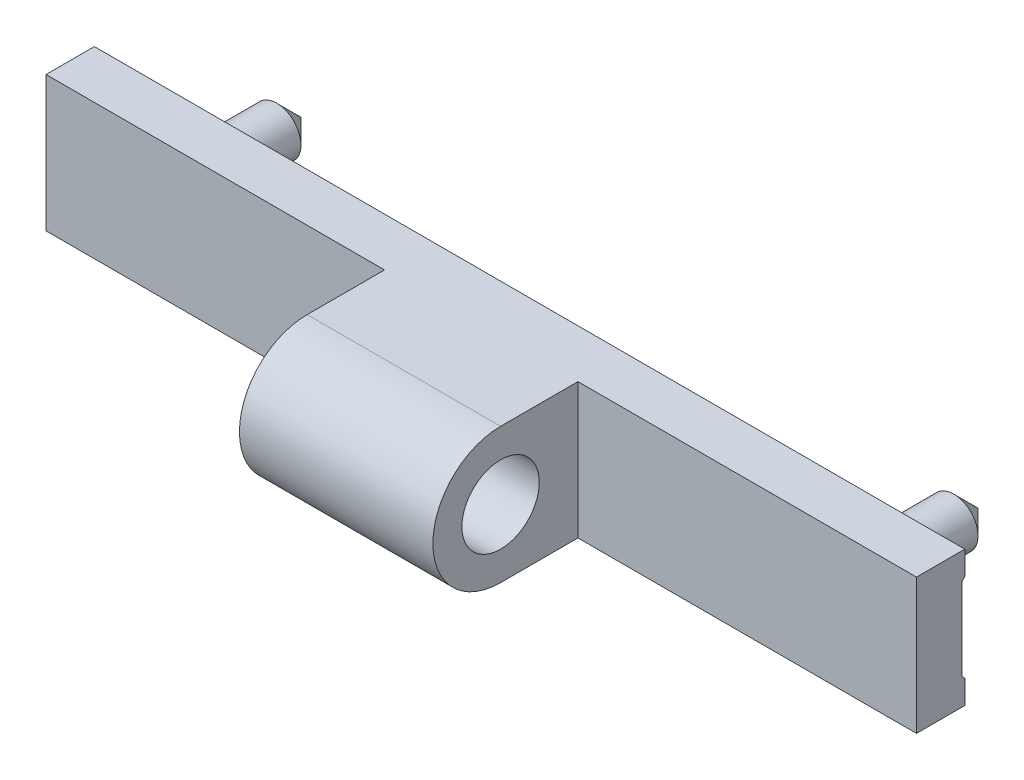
ISO-10303-21;
HEADER;
FILE_DESCRIPTION(('STEP AP214'),'2;1');
FILE_NAME('part.step','',(''),(''),'','','');
FILE_SCHEMA(('AUTOMOTIVE_DESIGN { 1 0 10303 214 1 1 1 1 }'));
ENDSEC;
DATA;
#1=APPLICATION_CONTEXT('core data for automotive mechanical design processes');
#2=APPLICATION_PROTOCOL_DEFINITION('international standard','automotive_design',2000,#1);
#3=PRODUCT_CONTEXT('',#1,'mechanical');
#4=PRODUCT('Part','Part','',(#3));
#5=PRODUCT_RELATED_PRODUCT_CATEGORY('part','',(#4));
#6=PRODUCT_DEFINITION_FORMATION('','',#4);
#7=PRODUCT_DEFINITION_CONTEXT('part definition',#1,'design');
#8=PRODUCT_DEFINITION('design','',#6,#7);
#9=PRODUCT_DEFINITION_SHAPE('','',#8);
#10=(LENGTH_UNIT() NAMED_UNIT(*) SI_UNIT(.MILLI.,.METRE.));
#11=(NAMED_UNIT(*) PLANE_ANGLE_UNIT() SI_UNIT($,.RADIAN.));
#12=(NAMED_UNIT(*) SI_UNIT($,.STERADIAN.) SOLID_ANGLE_UNIT());
#13=UNCERTAINTY_MEASURE_WITH_UNIT(LENGTH_MEASURE(1.E-05),#10,'distance_accuracy_value','');
#14=(GEOMETRIC_REPRESENTATION_CONTEXT(3) GLOBAL_UNCERTAINTY_ASSIGNED_CONTEXT((#13)) GLOBAL_UNIT_ASSIGNED_CONTEXT((#10,
#11,#12)) REPRESENTATION_CONTEXT('',''));
#15=CARTESIAN_POINT('',(0.,0.,0.));
#16=DIRECTION('',(0.,0.,1.));
#17=DIRECTION('',(1.,0.,0.));
#18=AXIS2_PLACEMENT_3D('',#15,#16,#17);
#19=CARTESIAN_POINT('',(80.,0.,13.));
#20=DIRECTION('',(-1.,0.,0.));
#21=DIRECTION('',(0.,-1.,0.));
#22=AXIS2_PLACEMENT_3D('',#19,#20,#21);
#23=CYLINDRICAL_SURFACE('',#22,7.);
#24=CARTESIAN_POINT('',(45.,0.,13.));
#25=DIRECTION('',(1.,0.,0.));
#26=DIRECTION('',(0.,1.,0.));
#27=AXIS2_PLACEMENT_3D('',#24,#25,#26);
#28=CIRCLE('',#27,7.);
#29=CARTESIAN_POINT('',(45.,7.,13.));
#30=VERTEX_POINT('',#29);
#31=CARTESIAN_POINT('',(45.,-7.,13.));
#32=VERTEX_POINT('',#31);
#33=EDGE_CURVE('E146',#30,#32,#28,.T.);
#34=ORIENTED_EDGE('',*,*,#33,.F.);
#35=DIRECTION('',(-1.,0.,0.));
#36=VECTOR('',#35,1.);
#37=CARTESIAN_POINT('',(80.,7.,13.));
#38=LINE('',#37,#36);
#39=CARTESIAN_POINT('',(25.,7.,13.));
#40=VERTEX_POINT('',#39);
#41=EDGE_CURVE('E165',#30,#40,#38,.T.);
#42=ORIENTED_EDGE('',*,*,#41,.T.);
#43=CARTESIAN_POINT('',(25.,0.,13.));
#44=DIRECTION('',(-1.,0.,0.));
#45=DIRECTION('',(0.,-1.,0.));
#46=AXIS2_PLACEMENT_3D('',#43,#44,#45);
#47=CIRCLE('',#46,7.);
#48=CARTESIAN_POINT('',(25.,-7.,13.));
#49=VERTEX_POINT('',#48);
#50=EDGE_CURVE('E141',#49,#40,#47,.T.);
#51=ORIENTED_EDGE('',*,*,#50,.F.);
#52=DIRECTION('',(-1.,0.,0.));
#53=VECTOR('',#52,1.);
#54=CARTESIAN_POINT('',(80.,-7.,13.));
#55=LINE('',#54,#53);
#56=EDGE_CURVE('E199',#32,#49,#55,.T.);
#57=ORIENTED_EDGE('',*,*,#56,.F.);
#58=EDGE_LOOP('',(#34,#42,#51,#57));
#59=FACE_BOUND('',#58,.T.);
#60=ADVANCED_FACE('F14',(#59),#23,.T.);
#61=CARTESIAN_POINT('',(80.,-7.,13.));
#62=DIRECTION('',(0.,1.,0.));
#63=DIRECTION('',(-1.,0.,0.));
#64=AXIS2_PLACEMENT_3D('',#61,#62,#63);
#65=PLANE('',#64);
#66=DIRECTION('',(0.,0.,-1.));
#67=VECTOR('',#66,1.);
#68=CARTESIAN_POINT('',(25.,-7.,25.));
#69=LINE('',#68,#67);
#70=CARTESIAN_POINT('',(25.,-7.,5.));
#71=VERTEX_POINT('',#70);
#72=EDGE_CURVE('E131',#49,#71,#69,.T.);
#73=ORIENTED_EDGE('',*,*,#72,.T.);
#74=DIRECTION('',(1.,0.,0.));
#75=VECTOR('',#74,1.);
#76=CARTESIAN_POINT('',(-10.,-7.,5.));
#77=LINE('',#76,#75);
#78=CARTESIAN_POINT('',(-10.,-7.,5.));
#79=VERTEX_POINT('',#78);
#80=EDGE_CURVE('E127',#79,#71,#77,.T.);
#81=ORIENTED_EDGE('',*,*,#80,.F.);
#82=DIRECTION('',(0.,0.,-1.));
#83=VECTOR('',#82,1.);
#84=CARTESIAN_POINT('',(-10.,-7.,13.));
#85=LINE('',#84,#83);
#86=CARTESIAN_POINT('',(-10.,-7.,0.));
#87=VERTEX_POINT('',#86);
#88=EDGE_CURVE('E148',#79,#87,#85,.T.);
#89=ORIENTED_EDGE('',*,*,#88,.T.);
#90=DIRECTION('',(-1.,0.,0.));
#91=VECTOR('',#90,1.);
#92=CARTESIAN_POINT('',(80.,-7.,0.));
#93=LINE('',#92,#91);
#94=CARTESIAN_POINT('',(80.,-7.,0.));
#95=VERTEX_POINT('',#94);
#96=EDGE_CURVE('E196',#95,#87,#93,.T.);
#97=ORIENTED_EDGE('',*,*,#96,.F.);
#98=DIRECTION('',(0.,0.,-1.));
#99=VECTOR('',#98,1.);
#100=CARTESIAN_POINT('',(80.,-7.,13.));
#101=LINE('',#100,#99);
#102=CARTESIAN_POINT('',(80.,-7.,5.));
#103=VERTEX_POINT('',#102);
#104=EDGE_CURVE('E149',#103,#95,#101,.T.);
#105=ORIENTED_EDGE('',*,*,#104,.F.);
#106=DIRECTION('',(1.,0.,0.));
#107=VECTOR('',#106,1.);
#108=CARTESIAN_POINT('',(45.,-7.,5.));
#109=LINE('',#108,#107);
#110=CARTESIAN_POINT('',(45.,-7.,5.));
#111=VERTEX_POINT('',#110);
#112=EDGE_CURVE('E28',#111,#103,#109,.T.);
#113=ORIENTED_EDGE('',*,*,#112,.F.);
#114=DIRECTION('',(0.,0.,-1.));
#115=VECTOR('',#114,1.);
#116=CARTESIAN_POINT('',(45.,-7.,25.));
#117=LINE('',#116,#115);
#118=EDGE_CURVE('E134',#32,#111,#117,.T.);
#119=ORIENTED_EDGE('',*,*,#118,.F.);
#120=ORIENTED_EDGE('',*,*,#56,.T.);
#121=EDGE_LOOP('',(#73,#81,#89,#97,#105,#113,#119,#120));
#122=FACE_BOUND('',#121,.T.);
#123=ADVANCED_FACE('F254',(#122),#65,.F.);
#124=CARTESIAN_POINT('',(80.,7.,0.));
#125=DIRECTION('',(0.,-1.,0.));
#126=DIRECTION('',(1.,0.,0.));
#127=AXIS2_PLACEMENT_3D('',#124,#125,#126);
#128=PLANE('',#127);
#129=DIRECTION('',(-1.,0.,0.));
#130=VECTOR('',#129,1.);
#131=CARTESIAN_POINT('',(80.,7.,5.));
#132=LINE('',#131,#130);
#133=CARTESIAN_POINT('',(80.,7.,5.));
#134=VERTEX_POINT('',#133);
#135=CARTESIAN_POINT('',(45.,7.,5.));
#136=VERTEX_POINT('',#135);
#137=EDGE_CURVE('E137',#134,#136,#132,.T.);
#138=ORIENTED_EDGE('',*,*,#137,.F.);
#139=DIRECTION('',(0.,0.,1.));
#140=VECTOR('',#139,1.);
#141=CARTESIAN_POINT('',(80.,7.,0.));
#142=LINE('',#141,#140);
#143=CARTESIAN_POINT('',(80.,7.,0.));
#144=VERTEX_POINT('',#143);
#145=EDGE_CURVE('E162',#144,#134,#142,.T.);
#146=ORIENTED_EDGE('',*,*,#145,.F.);
#147=DIRECTION('',(-1.,0.,0.));
#148=VECTOR('',#147,1.);
#149=CARTESIAN_POINT('',(80.,7.,0.));
#150=LINE('',#149,#148);
#151=CARTESIAN_POINT('',(-10.,7.,0.));
#152=VERTEX_POINT('',#151);
#153=EDGE_CURVE('E181',#144,#152,#150,.T.);
#154=ORIENTED_EDGE('',*,*,#153,.T.);
#155=DIRECTION('',(0.,0.,1.));
#156=VECTOR('',#155,1.);
#157=CARTESIAN_POINT('',(-10.,7.,0.));
#158=LINE('',#157,#156);
#159=CARTESIAN_POINT('',(-10.,7.,5.));
#160=VERTEX_POINT('',#159);
#161=EDGE_CURVE('E152',#152,#160,#158,.T.);
#162=ORIENTED_EDGE('',*,*,#161,.T.);
#163=CARTESIAN_POINT('',(25.,7.,5.));
#164=VERTEX_POINT('',#163);
#165=EDGE_CURVE('E36',#164,#160,#132,.T.);
#166=ORIENTED_EDGE('',*,*,#165,.F.);
#167=DIRECTION('',(0.,0.,-1.));
#168=VECTOR('',#167,1.);
#169=CARTESIAN_POINT('',(25.,7.,0.));
#170=LINE('',#169,#168);
#171=EDGE_CURVE('E204',#40,#164,#170,.T.);
#172=ORIENTED_EDGE('',*,*,#171,.F.);
#173=ORIENTED_EDGE('',*,*,#41,.F.);
#174=DIRECTION('',(0.,0.,1.));
#175=VECTOR('',#174,1.);
#176=CARTESIAN_POINT('',(45.,7.,0.));
#177=LINE('',#176,#175);
#178=EDGE_CURVE('E206',#136,#30,#177,.T.);
#179=ORIENTED_EDGE('',*,*,#178,.F.);
#180=EDGE_LOOP('',(#138,#146,#154,#162,#166,#172,#173,#179));
#181=FACE_BOUND('',#180,.T.);
#182=ADVANCED_FACE('F239',(#181),#128,.F.);
#183=CARTESIAN_POINT('',(80.,0.,13.));
#184=DIRECTION('',(1.,0.,0.));
#185=DIRECTION('',(0.,1.,0.));
#186=AXIS2_PLACEMENT_3D('',#183,#184,#185);
#187=PLANE('',#186);
#188=ORIENTED_EDGE('',*,*,#145,.T.);
#189=DIRECTION('',(0.,1.,0.));
#190=VECTOR('',#189,1.);
#191=CARTESIAN_POINT('',(80.,-7.,5.));
#192=LINE('',#191,#190);
#193=EDGE_CURVE('E125',#103,#134,#192,.T.);
#194=ORIENTED_EDGE('',*,*,#193,.F.);
#195=ORIENTED_EDGE('',*,*,#104,.T.);
#196=DIRECTION('',(0.,1.,0.));
#197=VECTOR('',#196,1.);
#198=CARTESIAN_POINT('',(80.,-7.,0.));
#199=LINE('',#198,#197);
#200=CARTESIAN_POINT('',(80.,-4.55,0.));
#201=VERTEX_POINT('',#200);
#202=EDGE_CURVE('E151',#95,#201,#199,.T.);
#203=ORIENTED_EDGE('',*,*,#202,.T.);
#204=DIRECTION('',(0.,0.707106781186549,0.707106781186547));
#205=VECTOR('',#204,1.);
#206=CARTESIAN_POINT('',(80.,-4.55,0.));
#207=LINE('',#206,#205);
#208=CARTESIAN_POINT('',(80.,-4.25,0.3));
#209=VERTEX_POINT('',#208);
#210=EDGE_CURVE('E154',#201,#209,#207,.T.);
#211=ORIENTED_EDGE('',*,*,#210,.T.);
#212=DIRECTION('',(0.,1.,0.));
#213=VECTOR('',#212,1.);
#214=CARTESIAN_POINT('',(80.,-4.25,0.3));
#215=LINE('',#214,#213);
#216=CARTESIAN_POINT('',(80.,4.25,0.3));
#217=VERTEX_POINT('',#216);
#218=EDGE_CURVE('E156',#209,#217,#215,.T.);
#219=ORIENTED_EDGE('',*,*,#218,.T.);
#220=DIRECTION('',(0.,0.707106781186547,-0.707106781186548));
#221=VECTOR('',#220,1.);
#222=CARTESIAN_POINT('',(80.,4.25,0.3));
#223=LINE('',#222,#221);
#224=CARTESIAN_POINT('',(80.,4.55,0.));
#225=VERTEX_POINT('',#224);
#226=EDGE_CURVE('E158',#217,#225,#223,.T.);
#227=ORIENTED_EDGE('',*,*,#226,.T.);
#228=DIRECTION('',(0.,1.,0.));
#229=VECTOR('',#228,1.);
#230=CARTESIAN_POINT('',(80.,4.55,0.));
#231=LINE('',#230,#229);
#232=EDGE_CURVE('E160',#225,#144,#231,.T.);
#233=ORIENTED_EDGE('',*,*,#232,.T.);
#234=EDGE_LOOP('',(#188,#194,#195,#203,#211,#219,#227,#233));
#235=FACE_BOUND('',#234,.T.);
#236=ADVANCED_FACE('F242',(#235),#187,.T.);
#237=CARTESIAN_POINT('',(-10.,0.,13.));
#238=DIRECTION('',(1.,0.,0.));
#239=DIRECTION('',(0.,1.,0.));
#240=AXIS2_PLACEMENT_3D('',#237,#238,#239);
#241=PLANE('',#240);
#242=DIRECTION('',(0.,-1.,0.));
#243=VECTOR('',#242,1.);
#244=CARTESIAN_POINT('',(-10.,0.,5.));
#245=LINE('',#244,#243);
#246=EDGE_CURVE('E202',#160,#79,#245,.T.);
#247=ORIENTED_EDGE('',*,*,#246,.F.);
#248=ORIENTED_EDGE('',*,*,#161,.F.);
#249=DIRECTION('',(0.,1.,0.));
#250=VECTOR('',#249,1.);
#251=CARTESIAN_POINT('',(-10.,4.55,0.));
#252=LINE('',#251,#250);
#253=CARTESIAN_POINT('',(-10.,4.55,0.));
#254=VERTEX_POINT('',#253);
#255=EDGE_CURVE('E175',#254,#152,#252,.T.);
#256=ORIENTED_EDGE('',*,*,#255,.F.);
#257=DIRECTION('',(0.,0.707106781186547,-0.707106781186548));
#258=VECTOR('',#257,1.);
#259=CARTESIAN_POINT('',(-10.,4.25,0.3));
#260=LINE('',#259,#258);
#261=CARTESIAN_POINT('',(-10.,4.25,0.3));
#262=VERTEX_POINT('',#261);
#263=EDGE_CURVE('E173',#262,#254,#260,.T.);
#264=ORIENTED_EDGE('',*,*,#263,.F.);
#265=DIRECTION('',(0.,1.,0.));
#266=VECTOR('',#265,1.);
#267=CARTESIAN_POINT('',(-10.,-4.25,0.3));
#268=LINE('',#267,#266);
#269=CARTESIAN_POINT('',(-10.,-4.25,0.3));
#270=VERTEX_POINT('',#269);
#271=EDGE_CURVE('E171',#270,#262,#268,.T.);
#272=ORIENTED_EDGE('',*,*,#271,.F.);
#273=DIRECTION('',(0.,0.707106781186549,0.707106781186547));
#274=VECTOR('',#273,1.);
#275=CARTESIAN_POINT('',(-10.,-4.55,0.));
#276=LINE('',#275,#274);
#277=CARTESIAN_POINT('',(-10.,-4.55,0.));
#278=VERTEX_POINT('',#277);
#279=EDGE_CURVE('E169',#278,#270,#276,.T.);
#280=ORIENTED_EDGE('',*,*,#279,.F.);
#281=DIRECTION('',(0.,1.,0.));
#282=VECTOR('',#281,1.);
#283=CARTESIAN_POINT('',(-10.,-7.,0.));
#284=LINE('',#283,#282);
#285=EDGE_CURVE('E167',#87,#278,#284,.T.);
#286=ORIENTED_EDGE('',*,*,#285,.F.);
#287=ORIENTED_EDGE('',*,*,#88,.F.);
#288=EDGE_LOOP('',(#247,#248,#256,#264,#272,#280,#286,#287));
#289=FACE_BOUND('',#288,.T.);
#290=ADVANCED_FACE('F230',(#289),#241,.F.);
#291=CARTESIAN_POINT('',(80.,-7.,0.));
#292=DIRECTION('',(0.,0.,1.));
#293=DIRECTION('',(1.,0.,0.));
#294=AXIS2_PLACEMENT_3D('',#291,#292,#293);
#295=PLANE('',#294);
#296=ORIENTED_EDGE('',*,*,#285,.T.);
#297=DIRECTION('',(-1.,0.,0.));
#298=VECTOR('',#297,1.);
#299=CARTESIAN_POINT('',(80.,-4.55,0.));
#300=LINE('',#299,#298);
#301=EDGE_CURVE('E193',#201,#278,#300,.T.);
#302=ORIENTED_EDGE('',*,*,#301,.F.);
#303=ORIENTED_EDGE('',*,*,#202,.F.);
#304=ORIENTED_EDGE('',*,*,#96,.T.);
#305=EDGE_LOOP('',(#296,#302,#303,#304));
#306=FACE_BOUND('',#305,.T.);
#307=ADVANCED_FACE('F251',(#306),#295,.F.);
#308=CARTESIAN_POINT('',(80.,-4.55,0.));
#309=DIRECTION('',(0.,-0.707106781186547,0.707106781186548));
#310=DIRECTION('',(0.,-0.707106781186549,-0.707106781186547));
#311=AXIS2_PLACEMENT_3D('',#308,#309,#310);
#312=PLANE('',#311);
#313=ORIENTED_EDGE('',*,*,#279,.T.);
#314=DIRECTION('',(-1.,0.,0.));
#315=VECTOR('',#314,1.);
#316=CARTESIAN_POINT('',(80.,-4.25,0.3));
#317=LINE('',#316,#315);
#318=EDGE_CURVE('E190',#209,#270,#317,.T.);
#319=ORIENTED_EDGE('',*,*,#318,.F.);
#320=ORIENTED_EDGE('',*,*,#210,.F.);
#321=ORIENTED_EDGE('',*,*,#301,.T.);
#322=EDGE_LOOP('',(#313,#319,#320,#321));
#323=FACE_BOUND('',#322,.T.);
#324=ADVANCED_FACE('F216',(#323),#312,.F.);
#325=CARTESIAN_POINT('',(80.,-4.25,0.3));
#326=DIRECTION('',(0.,0.,1.));
#327=DIRECTION('',(1.,0.,0.));
#328=AXIS2_PLACEMENT_3D('',#325,#326,#327);
#329=PLANE('',#328);
#330=CARTESIAN_POINT('',(0.,0.,0.3));
#331=DIRECTION('',(0.,0.,1.));
#332=DIRECTION('',(1.,0.,0.));
#333=AXIS2_PLACEMENT_3D('',#330,#331,#332);
#334=CIRCLE('',#333,2.5);
#335=CARTESIAN_POINT('',(2.5,0.,0.3));
#336=VERTEX_POINT('',#335);
#337=EDGE_CURVE('E9',#336,#336,#334,.F.);
#338=ORIENTED_EDGE('',*,*,#337,.F.);
#339=EDGE_LOOP('',(#338));
#340=FACE_BOUND('',#339,.T.);
#341=CARTESIAN_POINT('',(70.,0.,0.3));
#342=DIRECTION('',(0.,0.,1.));
#343=DIRECTION('',(1.,0.,0.));
#344=AXIS2_PLACEMENT_3D('',#341,#342,#343);
#345=CIRCLE('',#344,2.5);
#346=CARTESIAN_POINT('',(72.5,0.,0.3));
#347=VERTEX_POINT('',#346);
#348=EDGE_CURVE('E21',#347,#347,#345,.F.);
#349=ORIENTED_EDGE('',*,*,#348,.F.);
#350=EDGE_LOOP('',(#349));
#351=FACE_BOUND('',#350,.T.);
#352=ORIENTED_EDGE('',*,*,#271,.T.);
#353=DIRECTION('',(-1.,0.,0.));
#354=VECTOR('',#353,1.);
#355=CARTESIAN_POINT('',(80.,4.25,0.3));
#356=LINE('',#355,#354);
#357=EDGE_CURVE('E187',#217,#262,#356,.T.);
#358=ORIENTED_EDGE('',*,*,#357,.F.);
#359=ORIENTED_EDGE('',*,*,#218,.F.);
#360=ORIENTED_EDGE('',*,*,#318,.T.);
#361=EDGE_LOOP('',(#352,#358,#359,#360));
#362=FACE_BOUND('',#361,.T.);
#363=ADVANCED_FACE('F212',(#340,#351,#362),#329,.F.);
#364=CARTESIAN_POINT('',(80.,4.25,0.3));
#365=DIRECTION('',(0.,0.707106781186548,0.707106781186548));
#366=DIRECTION('',(0.,-0.707106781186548,0.707106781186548));
#367=AXIS2_PLACEMENT_3D('',#364,#365,#366);
#368=PLANE('',#367);
#369=ORIENTED_EDGE('',*,*,#263,.T.);
#370=DIRECTION('',(-1.,0.,0.));
#371=VECTOR('',#370,1.);
#372=CARTESIAN_POINT('',(80.,4.55,0.));
#373=LINE('',#372,#371);
#374=EDGE_CURVE('E184',#225,#254,#373,.T.);
#375=ORIENTED_EDGE('',*,*,#374,.F.);
#376=ORIENTED_EDGE('',*,*,#226,.F.);
#377=ORIENTED_EDGE('',*,*,#357,.T.);
#378=EDGE_LOOP('',(#369,#375,#376,#377));
#379=FACE_BOUND('',#378,.T.);
#380=ADVANCED_FACE('F215',(#379),#368,.F.);
#381=CARTESIAN_POINT('',(80.,4.55,0.));
#382=DIRECTION('',(0.,0.,1.));
#383=DIRECTION('',(0.,-1.,0.));
#384=AXIS2_PLACEMENT_3D('',#381,#382,#383);
#385=PLANE('',#384);
#386=ORIENTED_EDGE('',*,*,#255,.T.);
#387=ORIENTED_EDGE('',*,*,#153,.F.);
#388=ORIENTED_EDGE('',*,*,#232,.F.);
#389=ORIENTED_EDGE('',*,*,#374,.T.);
#390=EDGE_LOOP('',(#386,#387,#388,#389));
#391=FACE_BOUND('',#390,.T.);
#392=ADVANCED_FACE('F234',(#391),#385,.F.);
#393=CARTESIAN_POINT('',(35.,0.,5.));
#394=DIRECTION('',(0.,0.,1.));
#395=DIRECTION('',(1.,0.,0.));
#396=AXIS2_PLACEMENT_3D('',#393,#394,#395);
#397=PLANE('',#396);
#398=ORIENTED_EDGE('',*,*,#165,.T.);
#399=ORIENTED_EDGE('',*,*,#246,.T.);
#400=ORIENTED_EDGE('',*,*,#80,.T.);
#401=DIRECTION('',(0.,1.,0.));
#402=VECTOR('',#401,1.);
#403=CARTESIAN_POINT('',(25.,-7.,5.));
#404=LINE('',#403,#402);
#405=EDGE_CURVE('E129',#71,#164,#404,.T.);
#406=ORIENTED_EDGE('',*,*,#405,.T.);
#407=EDGE_LOOP('',(#398,#399,#400,#406));
#408=FACE_BOUND('',#407,.T.);
#409=ADVANCED_FACE('F257',(#408),#397,.T.);
#410=CARTESIAN_POINT('',(25.,-7.,25.));
#411=DIRECTION('',(-1.,0.,0.));
#412=DIRECTION('',(0.,-1.,0.));
#413=AXIS2_PLACEMENT_3D('',#410,#411,#412);
#414=PLANE('',#413);
#415=CARTESIAN_POINT('',(25.,0.,13.));
#416=DIRECTION('',(-1.,0.,0.));
#417=DIRECTION('',(0.,-1.,0.));
#418=AXIS2_PLACEMENT_3D('',#415,#416,#417);
#419=CIRCLE('',#418,4.);
#420=CARTESIAN_POINT('',(25.,-4.,13.));
#421=VERTEX_POINT('',#420);
#422=EDGE_CURVE('E138',#421,#421,#419,.T.);
#423=ORIENTED_EDGE('',*,*,#422,.F.);
#424=EDGE_LOOP('',(#423));
#425=FACE_BOUND('',#424,.T.);
#426=ORIENTED_EDGE('',*,*,#50,.T.);
#427=ORIENTED_EDGE('',*,*,#171,.T.);
#428=ORIENTED_EDGE('',*,*,#405,.F.);
#429=ORIENTED_EDGE('',*,*,#72,.F.);
#430=EDGE_LOOP('',(#426,#427,#428,#429));
#431=FACE_BOUND('',#430,.T.);
#432=ADVANCED_FACE('F259',(#425,#431),#414,.T.);
#433=CARTESIAN_POINT('',(45.,7.,25.));
#434=DIRECTION('',(1.,0.,0.));
#435=DIRECTION('',(0.,1.,0.));
#436=AXIS2_PLACEMENT_3D('',#433,#434,#435);
#437=PLANE('',#436);
#438=CARTESIAN_POINT('',(45.,0.,13.));
#439=DIRECTION('',(1.,0.,0.));
#440=DIRECTION('',(0.,1.,0.));
#441=AXIS2_PLACEMENT_3D('',#438,#439,#440);
#442=CIRCLE('',#441,4.);
#443=CARTESIAN_POINT('',(45.,4.,13.));
#444=VERTEX_POINT('',#443);
#445=EDGE_CURVE('E143',#444,#444,#442,.T.);
#446=ORIENTED_EDGE('',*,*,#445,.F.);
#447=EDGE_LOOP('',(#446));
#448=FACE_BOUND('',#447,.T.);
#449=ORIENTED_EDGE('',*,*,#33,.T.);
#450=ORIENTED_EDGE('',*,*,#118,.T.);
#451=DIRECTION('',(0.,-1.,0.));
#452=VECTOR('',#451,1.);
#453=CARTESIAN_POINT('',(45.,7.,5.));
#454=LINE('',#453,#452);
#455=EDGE_CURVE('E120',#136,#111,#454,.T.);
#456=ORIENTED_EDGE('',*,*,#455,.F.);
#457=ORIENTED_EDGE('',*,*,#178,.T.);
#458=EDGE_LOOP('',(#449,#450,#456,#457));
#459=FACE_BOUND('',#458,.T.);
#460=ADVANCED_FACE('F268',(#448,#459),#437,.T.);
#461=ORIENTED_EDGE('',*,*,#137,.T.);
#462=ORIENTED_EDGE('',*,*,#455,.T.);
#463=ORIENTED_EDGE('',*,*,#112,.T.);
#464=ORIENTED_EDGE('',*,*,#193,.T.);
#465=EDGE_LOOP('',(#461,#462,#463,#464));
#466=FACE_BOUND('',#465,.T.);
#467=ADVANCED_FACE('F270',(#466),#397,.T.);
#468=CARTESIAN_POINT('',(80.,0.,13.));
#469=DIRECTION('',(-1.,0.,0.));
#470=DIRECTION('',(0.,-1.,0.));
#471=AXIS2_PLACEMENT_3D('',#468,#469,#470);
#472=CYLINDRICAL_SURFACE('',#471,4.);
#473=ORIENTED_EDGE('',*,*,#422,.T.);
#474=EDGE_LOOP('',(#473));
#475=FACE_BOUND('',#474,.T.);
#476=ORIENTED_EDGE('',*,*,#445,.T.);
#477=EDGE_LOOP('',(#476));
#478=FACE_BOUND('',#477,.T.);
#479=ADVANCED_FACE('F272',(#475,#478),#472,.F.);
#480=CARTESIAN_POINT('',(70.,0.,-11.36));
#481=DIRECTION('',(0.,0.,-1.));
#482=DIRECTION('',(-1.,0.,0.));
#483=AXIS2_PLACEMENT_3D('',#480,#481,#482);
#484=CYLINDRICAL_SURFACE('',#483,2.5);
#485=CARTESIAN_POINT('',(70.,0.,-8.86));
#486=DIRECTION('',(0.,0.,-1.));
#487=DIRECTION('',(-1.,0.,0.));
#488=AXIS2_PLACEMENT_3D('',#485,#486,#487);
#489=CIRCLE('',#488,2.5);
#490=CARTESIAN_POINT('',(67.5,0.,-8.86));
#491=VERTEX_POINT('',#490);
#492=EDGE_CURVE('E117',#491,#491,#489,.T.);
#493=ORIENTED_EDGE('',*,*,#492,.F.);
#494=EDGE_LOOP('',(#493));
#495=FACE_BOUND('',#494,.T.);
#496=ORIENTED_EDGE('',*,*,#348,.T.);
#497=EDGE_LOOP('',(#496));
#498=FACE_BOUND('',#497,.T.);
#499=ADVANCED_FACE('F210',(#495,#498),#484,.T.);
#500=CARTESIAN_POINT('',(70.,0.,-8.86));
#501=DIRECTION('',(0.,0.,1.));
#502=DIRECTION('',(1.,0.,0.));
#503=AXIS2_PLACEMENT_3D('',#500,#501,#502);
#504=CONICAL_SURFACE('',#503,2.5,0.785398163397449);
#505=CARTESIAN_POINT('',(70.,0.,-11.36));
#506=VERTEX_POINT('',#505);
#507=VERTEX_LOOP('',#506);
#508=FACE_BOUND('',#507,.T.);
#509=ORIENTED_EDGE('',*,*,#492,.T.);
#510=EDGE_LOOP('',(#509));
#511=FACE_BOUND('',#510,.T.);
#512=ADVANCED_FACE('F408',(#508,#511),#504,.T.);
#513=CARTESIAN_POINT('',(0.,0.,-11.36));
#514=DIRECTION('',(0.,0.,-1.));
#515=DIRECTION('',(-1.,0.,0.));
#516=AXIS2_PLACEMENT_3D('',#513,#514,#515);
#517=CYLINDRICAL_SURFACE('',#516,2.5);
#518=CARTESIAN_POINT('',(0.,0.,-8.86));
#519=DIRECTION('',(0.,0.,-1.));
#520=DIRECTION('',(-1.,0.,0.));
#521=AXIS2_PLACEMENT_3D('',#518,#519,#520);
#522=CIRCLE('',#521,2.5);
#523=CARTESIAN_POINT('',(-2.5,0.,-8.86));
#524=VERTEX_POINT('',#523);
#525=EDGE_CURVE('E115',#524,#524,#522,.T.);
#526=ORIENTED_EDGE('',*,*,#525,.F.);
#527=EDGE_LOOP('',(#526));
#528=FACE_BOUND('',#527,.T.);
#529=ORIENTED_EDGE('',*,*,#337,.T.);
#530=EDGE_LOOP('',(#529));
#531=FACE_BOUND('',#530,.T.);
#532=ADVANCED_FACE('F111',(#528,#531),#517,.T.);
#533=CARTESIAN_POINT('',(0.,0.,-8.86));
#534=DIRECTION('',(0.,0.,1.));
#535=DIRECTION('',(1.,0.,0.));
#536=AXIS2_PLACEMENT_3D('',#533,#534,#535);
#537=CONICAL_SURFACE('',#536,2.5,0.785398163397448);
#538=CARTESIAN_POINT('',(0.,0.,-11.36));
#539=VERTEX_POINT('',#538);
#540=VERTEX_LOOP('',#539);
#541=FACE_BOUND('',#540,.T.);
#542=ORIENTED_EDGE('',*,*,#525,.T.);
#543=EDGE_LOOP('',(#542));
#544=FACE_BOUND('',#543,.T.);
#545=ADVANCED_FACE('F108',(#541,#544),#537,.T.);
#546=CLOSED_SHELL('',(#60,#123,#182,#236,#290,#307,#324,#363,#380,#392,#409,#432,#460,#467,#479,
#499,#512,#532,#545));
#547=MANIFOLD_SOLID_BREP('B1',#546);
#548=ADVANCED_BREP_SHAPE_REPRESENTATION('',(#18,#547),#14);
#549=SHAPE_DEFINITION_REPRESENTATION(#9,#548);
ENDSEC;
END-ISO-10303-21;
